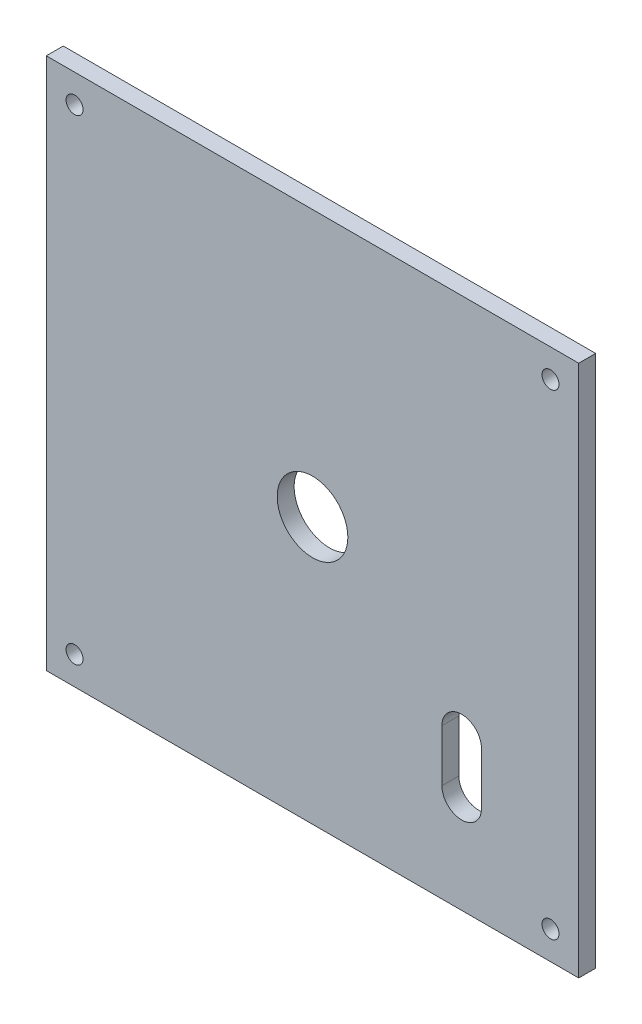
ISO-10303-21;
HEADER;
FILE_DESCRIPTION(('STEP AP214'),'2;1');
FILE_NAME('part.step','',(''),(''),'','','');
FILE_SCHEMA(('AUTOMOTIVE_DESIGN { 1 0 10303 214 1 1 1 1 }'));
ENDSEC;
DATA;
#1=APPLICATION_CONTEXT('core data for automotive mechanical design processes');
#2=APPLICATION_PROTOCOL_DEFINITION('international standard','automotive_design',2000,#1);
#3=PRODUCT_CONTEXT('',#1,'mechanical');
#4=PRODUCT('Part','Part','',(#3));
#5=PRODUCT_RELATED_PRODUCT_CATEGORY('part','',(#4));
#6=PRODUCT_DEFINITION_FORMATION('','',#4);
#7=PRODUCT_DEFINITION_CONTEXT('part definition',#1,'design');
#8=PRODUCT_DEFINITION('design','',#6,#7);
#9=PRODUCT_DEFINITION_SHAPE('','',#8);
#10=(LENGTH_UNIT() NAMED_UNIT(*) SI_UNIT(.MILLI.,.METRE.));
#11=(NAMED_UNIT(*) PLANE_ANGLE_UNIT() SI_UNIT($,.RADIAN.));
#12=(NAMED_UNIT(*) SI_UNIT($,.STERADIAN.) SOLID_ANGLE_UNIT());
#13=UNCERTAINTY_MEASURE_WITH_UNIT(LENGTH_MEASURE(1.E-05),#10,'distance_accuracy_value','');
#14=(GEOMETRIC_REPRESENTATION_CONTEXT(3) GLOBAL_UNCERTAINTY_ASSIGNED_CONTEXT((#13)) GLOBAL_UNIT_ASSIGNED_CONTEXT((#10,
#11,#12)) REPRESENTATION_CONTEXT('',''));
#15=CARTESIAN_POINT('',(0.,0.,0.));
#16=DIRECTION('',(0.,0.,1.));
#17=DIRECTION('',(1.,0.,0.));
#18=AXIS2_PLACEMENT_3D('',#15,#16,#17);
#19=CARTESIAN_POINT('',(4.99999999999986,0.,3.));
#20=DIRECTION('',(1.,0.,0.));
#21=DIRECTION('',(0.,0.,-1.));
#22=AXIS2_PLACEMENT_3D('',#19,#20,#21);
#23=PLANE('',#22);
#24=DIRECTION('',(0.,-1.,0.));
#25=VECTOR('',#24,1.);
#26=CARTESIAN_POINT('',(4.99999999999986,0.,0.));
#27=LINE('',#26,#25);
#28=CARTESIAN_POINT('',(4.99999999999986,5.,0.));
#29=VERTEX_POINT('',#28);
#30=CARTESIAN_POINT('',(4.99999999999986,-89.2,0.));
#31=VERTEX_POINT('',#30);
#32=EDGE_CURVE('E155',#29,#31,#27,.T.);
#33=ORIENTED_EDGE('',*,*,#32,.F.);
#34=DIRECTION('',(0.,0.,-1.));
#35=VECTOR('',#34,1.);
#36=CARTESIAN_POINT('',(4.99999999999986,5.,3.));
#37=LINE('',#36,#35);
#38=CARTESIAN_POINT('',(4.99999999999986,5.,3.));
#39=VERTEX_POINT('',#38);
#40=EDGE_CURVE('E11',#39,#29,#37,.T.);
#41=ORIENTED_EDGE('',*,*,#40,.F.);
#42=DIRECTION('',(0.,-1.,0.));
#43=VECTOR('',#42,1.);
#44=CARTESIAN_POINT('',(4.99999999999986,0.,3.));
#45=LINE('',#44,#43);
#46=CARTESIAN_POINT('',(4.99999999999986,-89.2,3.));
#47=VERTEX_POINT('',#46);
#48=EDGE_CURVE('E106',#39,#47,#45,.T.);
#49=ORIENTED_EDGE('',*,*,#48,.T.);
#50=DIRECTION('',(0.,0.,-1.));
#51=VECTOR('',#50,1.);
#52=CARTESIAN_POINT('',(4.99999999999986,-89.2,3.));
#53=LINE('',#52,#51);
#54=EDGE_CURVE('E37',#47,#31,#53,.T.);
#55=ORIENTED_EDGE('',*,*,#54,.T.);
#56=EDGE_LOOP('',(#33,#41,#49,#55));
#57=FACE_BOUND('',#56,.T.);
#58=ADVANCED_FACE('F17',(#57),#23,.T.);
#59=CARTESIAN_POINT('',(0.,5.,3.));
#60=DIRECTION('',(0.,1.,0.));
#61=DIRECTION('',(0.,0.,1.));
#62=AXIS2_PLACEMENT_3D('',#59,#60,#61);
#63=PLANE('',#62);
#64=DIRECTION('',(1.,0.,0.));
#65=VECTOR('',#64,1.);
#66=CARTESIAN_POINT('',(0.,5.,0.));
#67=LINE('',#66,#65);
#68=CARTESIAN_POINT('',(-89.2,5.,0.));
#69=VERTEX_POINT('',#68);
#70=EDGE_CURVE('E94',#69,#29,#67,.T.);
#71=ORIENTED_EDGE('',*,*,#70,.F.);
#72=DIRECTION('',(0.,0.,-1.));
#73=VECTOR('',#72,1.);
#74=CARTESIAN_POINT('',(-89.2,5.,3.));
#75=LINE('',#74,#73);
#76=CARTESIAN_POINT('',(-89.2,5.,3.));
#77=VERTEX_POINT('',#76);
#78=EDGE_CURVE('E28',#77,#69,#75,.T.);
#79=ORIENTED_EDGE('',*,*,#78,.F.);
#80=DIRECTION('',(1.,0.,0.));
#81=VECTOR('',#80,1.);
#82=CARTESIAN_POINT('',(0.,5.,3.));
#83=LINE('',#82,#81);
#84=EDGE_CURVE('E92',#77,#39,#83,.T.);
#85=ORIENTED_EDGE('',*,*,#84,.T.);
#86=ORIENTED_EDGE('',*,*,#40,.T.);
#87=EDGE_LOOP('',(#71,#79,#85,#86));
#88=FACE_BOUND('',#87,.T.);
#89=ADVANCED_FACE('F91',(#88),#63,.T.);
#90=CARTESIAN_POINT('',(-89.2,0.,3.));
#91=DIRECTION('',(-1.,0.,0.));
#92=DIRECTION('',(0.,0.,1.));
#93=AXIS2_PLACEMENT_3D('',#90,#91,#92);
#94=PLANE('',#93);
#95=DIRECTION('',(0.,1.,0.));
#96=VECTOR('',#95,1.);
#97=CARTESIAN_POINT('',(-89.2,0.,0.));
#98=LINE('',#97,#96);
#99=CARTESIAN_POINT('',(-89.2,-89.2,0.));
#100=VERTEX_POINT('',#99);
#101=EDGE_CURVE('E160',#100,#69,#98,.T.);
#102=ORIENTED_EDGE('',*,*,#101,.F.);
#103=DIRECTION('',(0.,0.,-1.));
#104=VECTOR('',#103,1.);
#105=CARTESIAN_POINT('',(-89.2,-89.2,3.));
#106=LINE('',#105,#104);
#107=CARTESIAN_POINT('',(-89.2,-89.2,3.));
#108=VERTEX_POINT('',#107);
#109=EDGE_CURVE('E62',#108,#100,#106,.T.);
#110=ORIENTED_EDGE('',*,*,#109,.F.);
#111=DIRECTION('',(0.,1.,0.));
#112=VECTOR('',#111,1.);
#113=CARTESIAN_POINT('',(-89.2,0.,3.));
#114=LINE('',#113,#112);
#115=EDGE_CURVE('E105',#108,#77,#114,.T.);
#116=ORIENTED_EDGE('',*,*,#115,.T.);
#117=ORIENTED_EDGE('',*,*,#78,.T.);
#118=EDGE_LOOP('',(#102,#110,#116,#117));
#119=FACE_BOUND('',#118,.T.);
#120=ADVANCED_FACE('F109',(#119),#94,.T.);
#121=CARTESIAN_POINT('',(-15.7070905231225,-71.8436055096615,3.));
#122=DIRECTION('',(0.,0.,-1.));
#123=DIRECTION('',(-1.,0.,0.));
#124=AXIS2_PLACEMENT_3D('',#121,#122,#123);
#125=CYLINDRICAL_SURFACE('',#124,3.5);
#126=CARTESIAN_POINT('',(-15.7070905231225,-71.8436055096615,0.));
#127=DIRECTION('',(0.,0.,1.));
#128=DIRECTION('',(1.,0.,0.));
#129=AXIS2_PLACEMENT_3D('',#126,#127,#128);
#130=CIRCLE('',#129,3.5);
#131=CARTESIAN_POINT('',(-19.2070905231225,-71.8436055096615,0.));
#132=VERTEX_POINT('',#131);
#133=CARTESIAN_POINT('',(-12.2070905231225,-71.8436055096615,0.));
#134=VERTEX_POINT('',#133);
#135=EDGE_CURVE('E119',#132,#134,#130,.T.);
#136=ORIENTED_EDGE('',*,*,#135,.F.);
#137=DIRECTION('',(0.,0.,-1.));
#138=VECTOR('',#137,1.);
#139=CARTESIAN_POINT('',(-19.2070905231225,-71.8436055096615,3.));
#140=LINE('',#139,#138);
#141=CARTESIAN_POINT('',(-19.2070905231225,-71.8436055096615,3.));
#142=VERTEX_POINT('',#141);
#143=EDGE_CURVE('E21',#142,#132,#140,.T.);
#144=ORIENTED_EDGE('',*,*,#143,.F.);
#145=CARTESIAN_POINT('',(-15.7070905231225,-71.8436055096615,3.));
#146=DIRECTION('',(0.,0.,1.));
#147=DIRECTION('',(1.,0.,0.));
#148=AXIS2_PLACEMENT_3D('',#145,#146,#147);
#149=CIRCLE('',#148,3.5);
#150=CARTESIAN_POINT('',(-12.2070905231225,-71.8436055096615,3.));
#151=VERTEX_POINT('',#150);
#152=EDGE_CURVE('E167',#142,#151,#149,.T.);
#153=ORIENTED_EDGE('',*,*,#152,.T.);
#154=DIRECTION('',(0.,0.,-1.));
#155=VECTOR('',#154,1.);
#156=CARTESIAN_POINT('',(-12.2070905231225,-71.8436055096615,3.));
#157=LINE('',#156,#155);
#158=EDGE_CURVE('E115',#151,#134,#157,.T.);
#159=ORIENTED_EDGE('',*,*,#158,.T.);
#160=EDGE_LOOP('',(#136,#144,#153,#159));
#161=FACE_BOUND('',#160,.T.);
#162=ADVANCED_FACE('F19',(#161),#125,.F.);
#163=CARTESIAN_POINT('',(-19.2070905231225,0.,3.));
#164=DIRECTION('',(1.,0.,0.));
#165=DIRECTION('',(0.,1.,0.));
#166=AXIS2_PLACEMENT_3D('',#163,#164,#165);
#167=PLANE('',#166);
#168=DIRECTION('',(0.,-1.,0.));
#169=VECTOR('',#168,1.);
#170=CARTESIAN_POINT('',(-19.2070905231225,0.,0.));
#171=LINE('',#170,#169);
#172=CARTESIAN_POINT('',(-19.2070905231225,-62.6436055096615,0.));
#173=VERTEX_POINT('',#172);
#174=EDGE_CURVE('E123',#173,#132,#171,.T.);
#175=ORIENTED_EDGE('',*,*,#174,.F.);
#176=DIRECTION('',(0.,0.,-1.));
#177=VECTOR('',#176,1.);
#178=CARTESIAN_POINT('',(-19.2070905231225,-62.6436055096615,3.));
#179=LINE('',#178,#177);
#180=CARTESIAN_POINT('',(-19.2070905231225,-62.6436055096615,3.));
#181=VERTEX_POINT('',#180);
#182=EDGE_CURVE('E176',#181,#173,#179,.T.);
#183=ORIENTED_EDGE('',*,*,#182,.F.);
#184=DIRECTION('',(0.,-1.,0.));
#185=VECTOR('',#184,1.);
#186=CARTESIAN_POINT('',(-19.2070905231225,0.,3.));
#187=LINE('',#186,#185);
#188=EDGE_CURVE('E187',#181,#142,#187,.T.);
#189=ORIENTED_EDGE('',*,*,#188,.T.);
#190=ORIENTED_EDGE('',*,*,#143,.T.);
#191=EDGE_LOOP('',(#175,#183,#189,#190));
#192=FACE_BOUND('',#191,.T.);
#193=ADVANCED_FACE('F185',(#192),#167,.T.);
#194=CARTESIAN_POINT('',(-15.7070905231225,-62.6436055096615,3.));
#195=DIRECTION('',(0.,0.,-1.));
#196=DIRECTION('',(-1.,0.,0.));
#197=AXIS2_PLACEMENT_3D('',#194,#195,#196);
#198=CYLINDRICAL_SURFACE('',#197,3.5);
#199=CARTESIAN_POINT('',(-15.7070905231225,-62.6436055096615,0.));
#200=DIRECTION('',(0.,0.,1.));
#201=DIRECTION('',(1.,0.,0.));
#202=AXIS2_PLACEMENT_3D('',#199,#200,#201);
#203=CIRCLE('',#202,3.5);
#204=CARTESIAN_POINT('',(-12.2070905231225,-62.6436055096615,0.));
#205=VERTEX_POINT('',#204);
#206=EDGE_CURVE('E127',#205,#173,#203,.T.);
#207=ORIENTED_EDGE('',*,*,#206,.F.);
#208=DIRECTION('',(0.,0.,-1.));
#209=VECTOR('',#208,1.);
#210=CARTESIAN_POINT('',(-12.2070905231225,-62.6436055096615,3.));
#211=LINE('',#210,#209);
#212=CARTESIAN_POINT('',(-12.2070905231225,-62.6436055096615,3.));
#213=VERTEX_POINT('',#212);
#214=EDGE_CURVE('E174',#213,#205,#211,.T.);
#215=ORIENTED_EDGE('',*,*,#214,.F.);
#216=CARTESIAN_POINT('',(-15.7070905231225,-62.6436055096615,3.));
#217=DIRECTION('',(0.,0.,1.));
#218=DIRECTION('',(1.,0.,0.));
#219=AXIS2_PLACEMENT_3D('',#216,#217,#218);
#220=CIRCLE('',#219,3.5);
#221=EDGE_CURVE('E196',#213,#181,#220,.T.);
#222=ORIENTED_EDGE('',*,*,#221,.T.);
#223=ORIENTED_EDGE('',*,*,#182,.T.);
#224=EDGE_LOOP('',(#207,#215,#222,#223));
#225=FACE_BOUND('',#224,.T.);
#226=ADVANCED_FACE('F193',(#225),#198,.F.);
#227=CARTESIAN_POINT('',(0.,0.,3.));
#228=DIRECTION('',(0.,0.,-1.));
#229=DIRECTION('',(-1.,0.,0.));
#230=AXIS2_PLACEMENT_3D('',#227,#228,#229);
#231=CYLINDRICAL_SURFACE('',#230,1.5);
#232=CARTESIAN_POINT('',(0.,0.,3.));
#233=DIRECTION('',(0.,0.,1.));
#234=DIRECTION('',(1.,0.,0.));
#235=AXIS2_PLACEMENT_3D('',#232,#233,#234);
#236=CIRCLE('',#235,1.5);
#237=CARTESIAN_POINT('',(1.5,0.,3.));
#238=VERTEX_POINT('',#237);
#239=EDGE_CURVE('E226',#238,#238,#236,.T.);
#240=ORIENTED_EDGE('',*,*,#239,.T.);
#241=EDGE_LOOP('',(#240));
#242=FACE_BOUND('',#241,.T.);
#243=CARTESIAN_POINT('',(0.,0.,0.));
#244=DIRECTION('',(0.,0.,1.));
#245=DIRECTION('',(1.,0.,0.));
#246=AXIS2_PLACEMENT_3D('',#243,#244,#245);
#247=CIRCLE('',#246,1.5);
#248=CARTESIAN_POINT('',(1.5,0.,0.));
#249=VERTEX_POINT('',#248);
#250=EDGE_CURVE('E151',#249,#249,#247,.T.);
#251=ORIENTED_EDGE('',*,*,#250,.F.);
#252=EDGE_LOOP('',(#251));
#253=FACE_BOUND('',#252,.T.);
#254=ADVANCED_FACE('F252',(#242,#253),#231,.F.);
#255=CARTESIAN_POINT('',(-1.52655665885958E-13,-84.2,3.));
#256=DIRECTION('',(0.,0.,-1.));
#257=DIRECTION('',(-1.,0.,0.));
#258=AXIS2_PLACEMENT_3D('',#255,#256,#257);
#259=CYLINDRICAL_SURFACE('',#258,1.50000000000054);
#260=CARTESIAN_POINT('',(-1.52655665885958E-13,-84.2,3.));
#261=DIRECTION('',(0.,0.,1.));
#262=DIRECTION('',(1.,0.,0.));
#263=AXIS2_PLACEMENT_3D('',#260,#261,#262);
#264=CIRCLE('',#263,1.50000000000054);
#265=CARTESIAN_POINT('',(1.50000000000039,-84.2,3.));
#266=VERTEX_POINT('',#265);
#267=EDGE_CURVE('E222',#266,#266,#264,.T.);
#268=ORIENTED_EDGE('',*,*,#267,.T.);
#269=EDGE_LOOP('',(#268));
#270=FACE_BOUND('',#269,.T.);
#271=CARTESIAN_POINT('',(-1.52655665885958E-13,-84.2,0.));
#272=DIRECTION('',(0.,0.,1.));
#273=DIRECTION('',(1.,0.,0.));
#274=AXIS2_PLACEMENT_3D('',#271,#272,#273);
#275=CIRCLE('',#274,1.50000000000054);
#276=CARTESIAN_POINT('',(1.50000000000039,-84.2,0.));
#277=VERTEX_POINT('',#276);
#278=EDGE_CURVE('E147',#277,#277,#275,.T.);
#279=ORIENTED_EDGE('',*,*,#278,.F.);
#280=EDGE_LOOP('',(#279));
#281=FACE_BOUND('',#280,.T.);
#282=ADVANCED_FACE('F255',(#270,#281),#259,.F.);
#283=CARTESIAN_POINT('',(-84.2,-84.2,3.));
#284=DIRECTION('',(0.,0.,-1.));
#285=DIRECTION('',(-1.,0.,0.));
#286=AXIS2_PLACEMENT_3D('',#283,#284,#285);
#287=CYLINDRICAL_SURFACE('',#286,1.50000000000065);
#288=CARTESIAN_POINT('',(-84.2,-84.2,3.));
#289=DIRECTION('',(0.,0.,1.));
#290=DIRECTION('',(1.,0.,0.));
#291=AXIS2_PLACEMENT_3D('',#288,#289,#290);
#292=CIRCLE('',#291,1.50000000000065);
#293=CARTESIAN_POINT('',(-82.6999999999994,-84.2,3.));
#294=VERTEX_POINT('',#293);
#295=EDGE_CURVE('E218',#294,#294,#292,.T.);
#296=ORIENTED_EDGE('',*,*,#295,.T.);
#297=EDGE_LOOP('',(#296));
#298=FACE_BOUND('',#297,.T.);
#299=CARTESIAN_POINT('',(-84.2,-84.2,0.));
#300=DIRECTION('',(0.,0.,1.));
#301=DIRECTION('',(1.,0.,0.));
#302=AXIS2_PLACEMENT_3D('',#299,#300,#301);
#303=CIRCLE('',#302,1.50000000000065);
#304=CARTESIAN_POINT('',(-82.6999999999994,-84.2,0.));
#305=VERTEX_POINT('',#304);
#306=EDGE_CURVE('E143',#305,#305,#303,.T.);
#307=ORIENTED_EDGE('',*,*,#306,.F.);
#308=EDGE_LOOP('',(#307));
#309=FACE_BOUND('',#308,.T.);
#310=ADVANCED_FACE('F259',(#298,#309),#287,.F.);
#311=CARTESIAN_POINT('',(-84.2,1.38777878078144E-13,3.));
#312=DIRECTION('',(0.,0.,-1.));
#313=DIRECTION('',(-1.,0.,0.));
#314=AXIS2_PLACEMENT_3D('',#311,#312,#313);
#315=CYLINDRICAL_SURFACE('',#314,1.50000000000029);
#316=CARTESIAN_POINT('',(-84.2,1.38777878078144E-13,3.));
#317=DIRECTION('',(0.,0.,1.));
#318=DIRECTION('',(1.,0.,0.));
#319=AXIS2_PLACEMENT_3D('',#316,#317,#318);
#320=CIRCLE('',#319,1.50000000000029);
#321=CARTESIAN_POINT('',(-82.6999999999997,1.38777878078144E-13,3.));
#322=VERTEX_POINT('',#321);
#323=EDGE_CURVE('E214',#322,#322,#320,.T.);
#324=ORIENTED_EDGE('',*,*,#323,.T.);
#325=EDGE_LOOP('',(#324));
#326=FACE_BOUND('',#325,.T.);
#327=CARTESIAN_POINT('',(-84.2,1.38777878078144E-13,0.));
#328=DIRECTION('',(0.,0.,1.));
#329=DIRECTION('',(1.,0.,0.));
#330=AXIS2_PLACEMENT_3D('',#327,#328,#329);
#331=CIRCLE('',#330,1.50000000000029);
#332=CARTESIAN_POINT('',(-82.6999999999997,1.38777878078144E-13,0.));
#333=VERTEX_POINT('',#332);
#334=EDGE_CURVE('E139',#333,#333,#331,.T.);
#335=ORIENTED_EDGE('',*,*,#334,.F.);
#336=EDGE_LOOP('',(#335));
#337=FACE_BOUND('',#336,.T.);
#338=ADVANCED_FACE('F263',(#326,#337),#315,.F.);
#339=CARTESIAN_POINT('',(-42.1,-42.1,3.));
#340=DIRECTION('',(0.,0.,-1.));
#341=DIRECTION('',(-1.,0.,0.));
#342=AXIS2_PLACEMENT_3D('',#339,#340,#341);
#343=CYLINDRICAL_SURFACE('',#342,6.25);
#344=CARTESIAN_POINT('',(-42.1,-42.1,3.));
#345=DIRECTION('',(0.,0.,1.));
#346=DIRECTION('',(1.,0.,0.));
#347=AXIS2_PLACEMENT_3D('',#344,#345,#346);
#348=CIRCLE('',#347,6.25);
#349=CARTESIAN_POINT('',(-35.85,-42.1,3.));
#350=VERTEX_POINT('',#349);
#351=EDGE_CURVE('E202',#350,#350,#348,.T.);
#352=ORIENTED_EDGE('',*,*,#351,.T.);
#353=EDGE_LOOP('',(#352));
#354=FACE_BOUND('',#353,.T.);
#355=CARTESIAN_POINT('',(-42.1,-42.1,0.));
#356=DIRECTION('',(0.,0.,1.));
#357=DIRECTION('',(1.,0.,0.));
#358=AXIS2_PLACEMENT_3D('',#355,#356,#357);
#359=CIRCLE('',#358,6.25);
#360=CARTESIAN_POINT('',(-35.85,-42.1,0.));
#361=VERTEX_POINT('',#360);
#362=EDGE_CURVE('E135',#361,#361,#359,.T.);
#363=ORIENTED_EDGE('',*,*,#362,.F.);
#364=EDGE_LOOP('',(#363));
#365=FACE_BOUND('',#364,.T.);
#366=ADVANCED_FACE('F240',(#354,#365),#343,.F.);
#367=CARTESIAN_POINT('',(-12.2070905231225,0.,3.));
#368=DIRECTION('',(1.,0.,0.));
#369=DIRECTION('',(0.,0.,-1.));
#370=AXIS2_PLACEMENT_3D('',#367,#368,#369);
#371=PLANE('',#370);
#372=DIRECTION('',(0.,-1.,0.));
#373=VECTOR('',#372,1.);
#374=CARTESIAN_POINT('',(-12.2070905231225,0.,0.));
#375=LINE('',#374,#373);
#376=EDGE_CURVE('E131',#205,#134,#375,.T.);
#377=ORIENTED_EDGE('',*,*,#376,.T.);
#378=ORIENTED_EDGE('',*,*,#158,.F.);
#379=DIRECTION('',(0.,-1.,0.));
#380=VECTOR('',#379,1.);
#381=CARTESIAN_POINT('',(-12.2070905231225,0.,3.));
#382=LINE('',#381,#380);
#383=EDGE_CURVE('E198',#213,#151,#382,.T.);
#384=ORIENTED_EDGE('',*,*,#383,.F.);
#385=ORIENTED_EDGE('',*,*,#214,.T.);
#386=EDGE_LOOP('',(#377,#378,#384,#385));
#387=FACE_BOUND('',#386,.T.);
#388=ADVANCED_FACE('F199',(#387),#371,.F.);
#389=CARTESIAN_POINT('',(0.,-89.2,3.));
#390=DIRECTION('',(0.,-1.,0.));
#391=DIRECTION('',(0.,0.,-1.));
#392=AXIS2_PLACEMENT_3D('',#389,#390,#391);
#393=PLANE('',#392);
#394=DIRECTION('',(-1.,0.,0.));
#395=VECTOR('',#394,1.);
#396=CARTESIAN_POINT('',(0.,-89.2,0.));
#397=LINE('',#396,#395);
#398=EDGE_CURVE('E163',#31,#100,#397,.T.);
#399=ORIENTED_EDGE('',*,*,#398,.F.);
#400=ORIENTED_EDGE('',*,*,#54,.F.);
#401=DIRECTION('',(-1.,0.,0.));
#402=VECTOR('',#401,1.);
#403=CARTESIAN_POINT('',(0.,-89.2,3.));
#404=LINE('',#403,#402);
#405=EDGE_CURVE('E111',#47,#108,#404,.T.);
#406=ORIENTED_EDGE('',*,*,#405,.T.);
#407=ORIENTED_EDGE('',*,*,#109,.T.);
#408=EDGE_LOOP('',(#399,#400,#406,#407));
#409=FACE_BOUND('',#408,.T.);
#410=ADVANCED_FACE('F230',(#409),#393,.T.);
#411=CARTESIAN_POINT('',(0.,0.,3.));
#412=DIRECTION('',(0.,0.,1.));
#413=DIRECTION('',(1.,0.,0.));
#414=AXIS2_PLACEMENT_3D('',#411,#412,#413);
#415=PLANE('',#414);
#416=ORIENTED_EDGE('',*,*,#152,.F.);
#417=ORIENTED_EDGE('',*,*,#188,.F.);
#418=ORIENTED_EDGE('',*,*,#221,.F.);
#419=ORIENTED_EDGE('',*,*,#383,.T.);
#420=EDGE_LOOP('',(#416,#417,#418,#419));
#421=FACE_BOUND('',#420,.T.);
#422=ORIENTED_EDGE('',*,*,#351,.F.);
#423=EDGE_LOOP('',(#422));
#424=FACE_BOUND('',#423,.T.);
#425=ORIENTED_EDGE('',*,*,#323,.F.);
#426=EDGE_LOOP('',(#425));
#427=FACE_BOUND('',#426,.T.);
#428=ORIENTED_EDGE('',*,*,#295,.F.);
#429=EDGE_LOOP('',(#428));
#430=FACE_BOUND('',#429,.T.);
#431=ORIENTED_EDGE('',*,*,#267,.F.);
#432=EDGE_LOOP('',(#431));
#433=FACE_BOUND('',#432,.T.);
#434=ORIENTED_EDGE('',*,*,#239,.F.);
#435=EDGE_LOOP('',(#434));
#436=FACE_BOUND('',#435,.T.);
#437=ORIENTED_EDGE('',*,*,#48,.F.);
#438=ORIENTED_EDGE('',*,*,#84,.F.);
#439=ORIENTED_EDGE('',*,*,#115,.F.);
#440=ORIENTED_EDGE('',*,*,#405,.F.);
#441=EDGE_LOOP('',(#437,#438,#439,#440));
#442=FACE_BOUND('',#441,.T.);
#443=ADVANCED_FACE('F103',(#421,#424,#427,#430,#433,#436,#442),#415,.T.);
#444=CARTESIAN_POINT('',(0.,0.,0.));
#445=DIRECTION('',(0.,0.,1.));
#446=DIRECTION('',(1.,0.,0.));
#447=AXIS2_PLACEMENT_3D('',#444,#445,#446);
#448=PLANE('',#447);
#449=ORIENTED_EDGE('',*,*,#135,.T.);
#450=ORIENTED_EDGE('',*,*,#376,.F.);
#451=ORIENTED_EDGE('',*,*,#206,.T.);
#452=ORIENTED_EDGE('',*,*,#174,.T.);
#453=EDGE_LOOP('',(#449,#450,#451,#452));
#454=FACE_BOUND('',#453,.T.);
#455=ORIENTED_EDGE('',*,*,#362,.T.);
#456=EDGE_LOOP('',(#455));
#457=FACE_BOUND('',#456,.T.);
#458=ORIENTED_EDGE('',*,*,#334,.T.);
#459=EDGE_LOOP('',(#458));
#460=FACE_BOUND('',#459,.T.);
#461=ORIENTED_EDGE('',*,*,#306,.T.);
#462=EDGE_LOOP('',(#461));
#463=FACE_BOUND('',#462,.T.);
#464=ORIENTED_EDGE('',*,*,#278,.T.);
#465=EDGE_LOOP('',(#464));
#466=FACE_BOUND('',#465,.T.);
#467=ORIENTED_EDGE('',*,*,#250,.T.);
#468=EDGE_LOOP('',(#467));
#469=FACE_BOUND('',#468,.T.);
#470=ORIENTED_EDGE('',*,*,#32,.T.);
#471=ORIENTED_EDGE('',*,*,#398,.T.);
#472=ORIENTED_EDGE('',*,*,#101,.T.);
#473=ORIENTED_EDGE('',*,*,#70,.T.);
#474=EDGE_LOOP('',(#470,#471,#472,#473));
#475=FACE_BOUND('',#474,.T.);
#476=ADVANCED_FACE('F191',(#454,#457,#460,#463,#466,#469,#475),#448,.F.);
#477=CLOSED_SHELL('',(#58,#89,#120,#162,#193,#226,#254,#282,#310,#338,#366,#388,#410,#443,#476));
#478=MANIFOLD_SOLID_BREP('B1',#477);
#479=ADVANCED_BREP_SHAPE_REPRESENTATION('',(#18,#478),#14);
#480=SHAPE_DEFINITION_REPRESENTATION(#9,#479);
ENDSEC;
END-ISO-10303-21;
